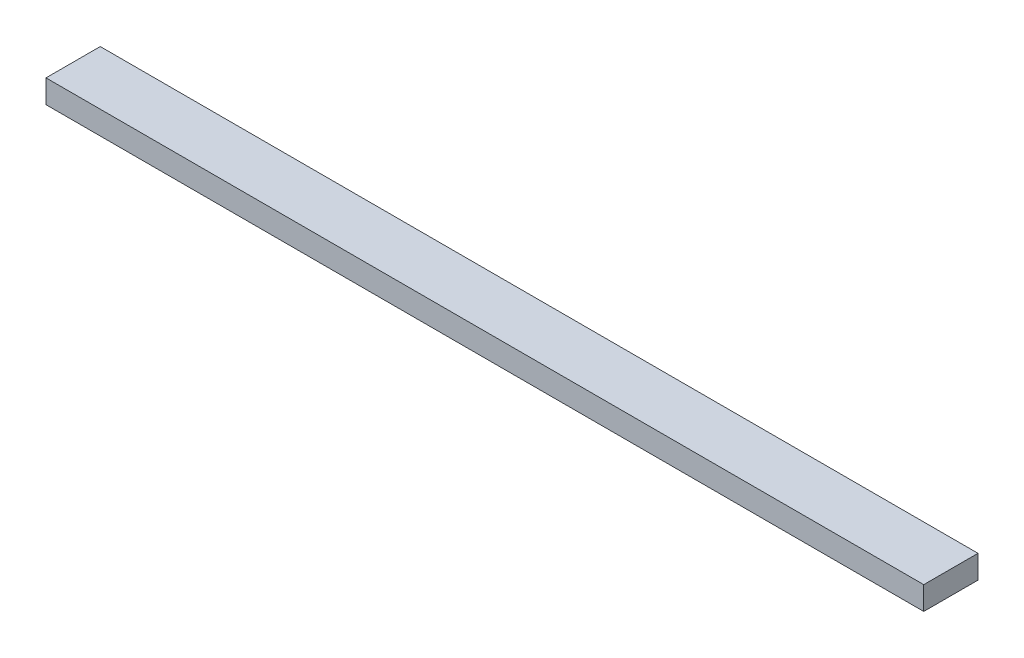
from build123d import *

# Parameters (mm, degrees)
SKETCH1_W           = 88.9
SKETCH1_H           = 38.1
BOSS_EXTRUDE1_DEPTH = 1438.275


with BuildPart() as part:
    # Sketch1 → Boss-Extrude1 (new body)
    with BuildSketch(Plane(origin=(0, 0, 0), x_dir=(0, 0, -1), z_dir=(1, 0, 0))):
        with Locations((44.45, 19.05)):
            Rectangle(SKETCH1_W, SKETCH1_H)
    extrude(amount=BOSS_EXTRUDE1_DEPTH)


solid = part.part
